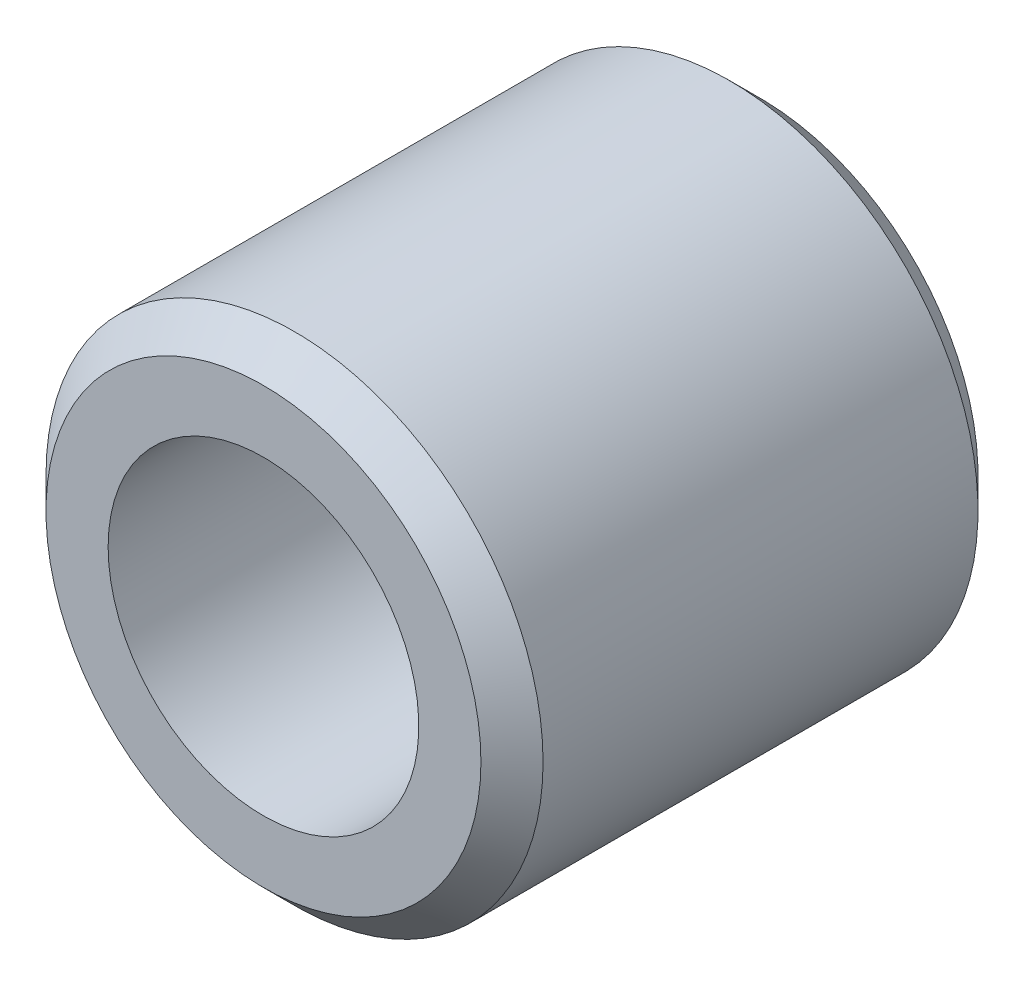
ISO-10303-21;
HEADER;
FILE_DESCRIPTION(('STEP AP214'),'2;1');
FILE_NAME('part.step','',(''),(''),'','','');
FILE_SCHEMA(('AUTOMOTIVE_DESIGN { 1 0 10303 214 1 1 1 1 }'));
ENDSEC;
DATA;
#1=APPLICATION_CONTEXT('core data for automotive mechanical design processes');
#2=APPLICATION_PROTOCOL_DEFINITION('international standard','automotive_design',2000,#1);
#3=PRODUCT_CONTEXT('',#1,'mechanical');
#4=PRODUCT('Part','Part','',(#3));
#5=PRODUCT_RELATED_PRODUCT_CATEGORY('part','',(#4));
#6=PRODUCT_DEFINITION_FORMATION('','',#4);
#7=PRODUCT_DEFINITION_CONTEXT('part definition',#1,'design');
#8=PRODUCT_DEFINITION('design','',#6,#7);
#9=PRODUCT_DEFINITION_SHAPE('','',#8);
#10=(LENGTH_UNIT() NAMED_UNIT(*) SI_UNIT(.MILLI.,.METRE.));
#11=(NAMED_UNIT(*) PLANE_ANGLE_UNIT() SI_UNIT($,.RADIAN.));
#12=(NAMED_UNIT(*) SI_UNIT($,.STERADIAN.) SOLID_ANGLE_UNIT());
#13=UNCERTAINTY_MEASURE_WITH_UNIT(LENGTH_MEASURE(1.E-05),#10,'distance_accuracy_value','');
#14=(GEOMETRIC_REPRESENTATION_CONTEXT(3) GLOBAL_UNCERTAINTY_ASSIGNED_CONTEXT((#13)) GLOBAL_UNIT_ASSIGNED_CONTEXT((#10,
#11,#12)) REPRESENTATION_CONTEXT('',''));
#15=CARTESIAN_POINT('',(0.,0.,0.));
#16=DIRECTION('',(0.,0.,1.));
#17=DIRECTION('',(1.,0.,0.));
#18=AXIS2_PLACEMENT_3D('',#15,#16,#17);
#19=CARTESIAN_POINT('',(0.,0.,0.));
#20=DIRECTION('',(0.,0.,-1.));
#21=DIRECTION('',(-1.,0.,0.));
#22=AXIS2_PLACEMENT_3D('',#19,#20,#21);
#23=CYLINDRICAL_SURFACE('',#22,5.);
#24=CARTESIAN_POINT('',(0.,0.,0.));
#25=DIRECTION('',(0.,0.,-1.));
#26=DIRECTION('',(-1.,0.,0.));
#27=AXIS2_PLACEMENT_3D('',#24,#25,#26);
#28=CIRCLE('',#27,5.);
#29=CARTESIAN_POINT('',(-5.,0.,0.));
#30=VERTEX_POINT('',#29);
#31=EDGE_CURVE('E34',#30,#30,#28,.T.);
#32=ORIENTED_EDGE('',*,*,#31,.T.);
#33=EDGE_LOOP('',(#32));
#34=FACE_BOUND('',#33,.T.);
#35=CARTESIAN_POINT('',(0.,0.,16.));
#36=DIRECTION('',(0.,0.,-1.));
#37=DIRECTION('',(-1.,0.,0.));
#38=AXIS2_PLACEMENT_3D('',#35,#36,#37);
#39=CIRCLE('',#38,5.);
#40=CARTESIAN_POINT('',(-5.,0.,16.));
#41=VERTEX_POINT('',#40);
#42=EDGE_CURVE('E31',#41,#41,#39,.T.);
#43=ORIENTED_EDGE('',*,*,#42,.F.);
#44=EDGE_LOOP('',(#43));
#45=FACE_BOUND('',#44,.T.);
#46=ADVANCED_FACE('F12',(#34,#45),#23,.F.);
#47=CARTESIAN_POINT('',(-5.,0.,16.));
#48=DIRECTION('',(0.,0.,1.));
#49=DIRECTION('',(1.,0.,0.));
#50=AXIS2_PLACEMENT_3D('',#47,#48,#49);
#51=PLANE('',#50);
#52=CARTESIAN_POINT('',(0.,0.,16.));
#53=DIRECTION('',(0.,0.,1.));
#54=DIRECTION('',(1.,0.,0.));
#55=AXIS2_PLACEMENT_3D('',#52,#53,#54);
#56=CIRCLE('',#55,7.);
#57=CARTESIAN_POINT('',(7.,0.,16.));
#58=VERTEX_POINT('',#57);
#59=EDGE_CURVE('E8',#58,#58,#56,.T.);
#60=ORIENTED_EDGE('',*,*,#59,.T.);
#61=EDGE_LOOP('',(#60));
#62=FACE_BOUND('',#61,.T.);
#63=ORIENTED_EDGE('',*,*,#42,.T.);
#64=EDGE_LOOP('',(#63));
#65=FACE_BOUND('',#64,.T.);
#66=ADVANCED_FACE('F55',(#62,#65),#51,.T.);
#67=CARTESIAN_POINT('',(0.,0.,0.));
#68=DIRECTION('',(0.,0.,-1.));
#69=DIRECTION('',(-1.,0.,0.));
#70=AXIS2_PLACEMENT_3D('',#67,#68,#69);
#71=CYLINDRICAL_SURFACE('',#70,8.);
#72=CARTESIAN_POINT('',(0.,0.,0.999999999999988));
#73=DIRECTION('',(0.,0.,-1.));
#74=DIRECTION('',(-1.,0.,0.));
#75=AXIS2_PLACEMENT_3D('',#72,#73,#74);
#76=CIRCLE('',#75,8.);
#77=CARTESIAN_POINT('',(-8.,0.,0.999999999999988));
#78=VERTEX_POINT('',#77);
#79=EDGE_CURVE('E18',#78,#78,#76,.F.);
#80=ORIENTED_EDGE('',*,*,#79,.T.);
#81=EDGE_LOOP('',(#80));
#82=FACE_BOUND('',#81,.T.);
#83=CARTESIAN_POINT('',(0.,0.,15.));
#84=DIRECTION('',(0.,0.,1.));
#85=DIRECTION('',(1.,0.,0.));
#86=AXIS2_PLACEMENT_3D('',#83,#84,#85);
#87=CIRCLE('',#86,8.);
#88=CARTESIAN_POINT('',(8.,0.,15.));
#89=VERTEX_POINT('',#88);
#90=EDGE_CURVE('E22',#89,#89,#87,.F.);
#91=ORIENTED_EDGE('',*,*,#90,.T.);
#92=EDGE_LOOP('',(#91));
#93=FACE_BOUND('',#92,.T.);
#94=ADVANCED_FACE('F43',(#82,#93),#71,.T.);
#95=CARTESIAN_POINT('',(-5.,0.,0.));
#96=DIRECTION('',(0.,0.,-1.));
#97=DIRECTION('',(-1.,0.,0.));
#98=AXIS2_PLACEMENT_3D('',#95,#96,#97);
#99=PLANE('',#98);
#100=CARTESIAN_POINT('',(0.,0.,0.));
#101=DIRECTION('',(0.,0.,-1.));
#102=DIRECTION('',(-1.,0.,0.));
#103=AXIS2_PLACEMENT_3D('',#100,#101,#102);
#104=CIRCLE('',#103,7.);
#105=CARTESIAN_POINT('',(-7.,0.,0.));
#106=VERTEX_POINT('',#105);
#107=EDGE_CURVE('E26',#106,#106,#104,.T.);
#108=ORIENTED_EDGE('',*,*,#107,.T.);
#109=EDGE_LOOP('',(#108));
#110=FACE_BOUND('',#109,.T.);
#111=ORIENTED_EDGE('',*,*,#31,.F.);
#112=EDGE_LOOP('',(#111));
#113=FACE_BOUND('',#112,.T.);
#114=ADVANCED_FACE('F40',(#110,#113),#99,.T.);
#115=CARTESIAN_POINT('',(0.,0.,0.));
#116=DIRECTION('',(0.,0.,1.));
#117=DIRECTION('',(1.,0.,0.));
#118=AXIS2_PLACEMENT_3D('',#115,#116,#117);
#119=CONICAL_SURFACE('',#118,7.,0.785398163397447);
#120=ORIENTED_EDGE('',*,*,#79,.F.);
#121=EDGE_LOOP('',(#120));
#122=FACE_BOUND('',#121,.T.);
#123=ORIENTED_EDGE('',*,*,#107,.F.);
#124=EDGE_LOOP('',(#123));
#125=FACE_BOUND('',#124,.T.);
#126=ADVANCED_FACE('F42',(#122,#125),#119,.T.);
#127=CARTESIAN_POINT('',(0.,0.,15.));
#128=DIRECTION('',(0.,0.,-1.));
#129=DIRECTION('',(-1.,0.,0.));
#130=AXIS2_PLACEMENT_3D('',#127,#128,#129);
#131=CONICAL_SURFACE('',#130,8.,0.785398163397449);
#132=ORIENTED_EDGE('',*,*,#59,.F.);
#133=EDGE_LOOP('',(#132));
#134=FACE_BOUND('',#133,.T.);
#135=ORIENTED_EDGE('',*,*,#90,.F.);
#136=EDGE_LOOP('',(#135));
#137=FACE_BOUND('',#136,.T.);
#138=ADVANCED_FACE('F52',(#134,#137),#131,.T.);
#139=CLOSED_SHELL('',(#46,#66,#94,#114,#126,#138));
#140=MANIFOLD_SOLID_BREP('B1',#139);
#141=ADVANCED_BREP_SHAPE_REPRESENTATION('',(#18,#140),#14);
#142=SHAPE_DEFINITION_REPRESENTATION(#9,#141);
ENDSEC;
END-ISO-10303-21;
